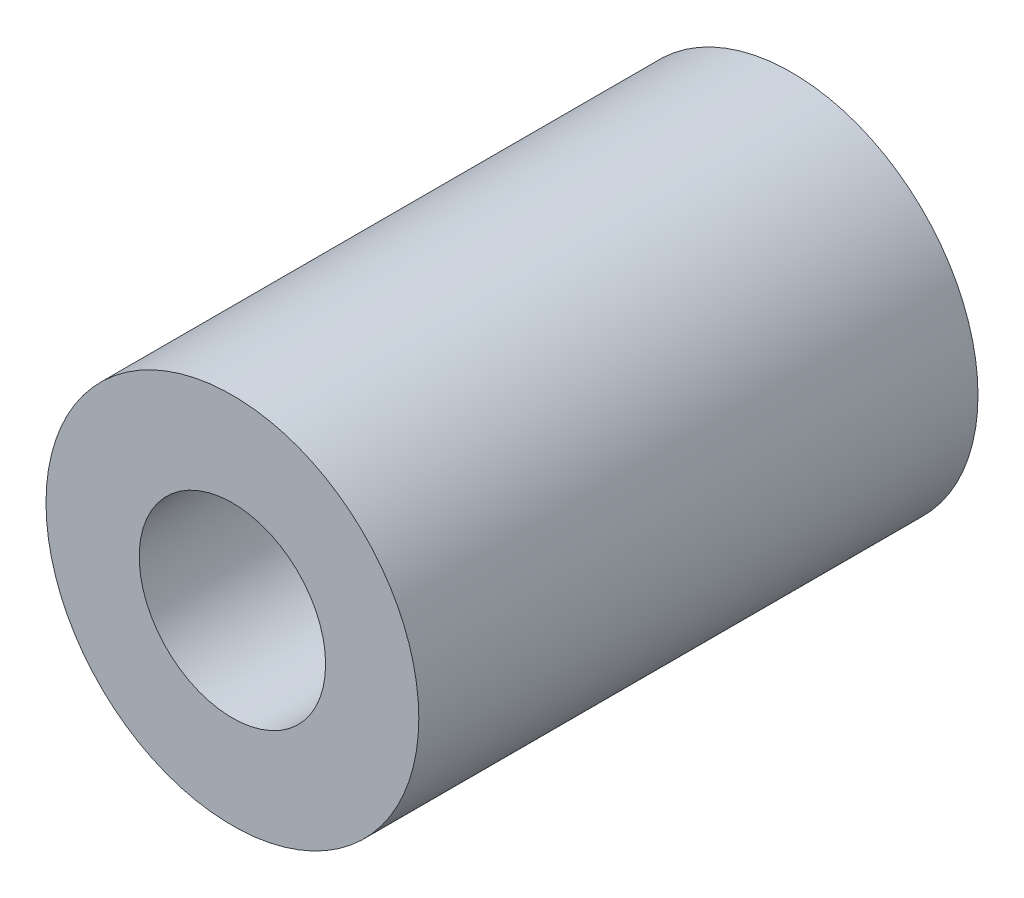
from build123d import *

# Parameters (mm, degrees)
SKETCH1_R          = 10
EXTRUDE1_DEPTH     = 30
SKETCH2_R          = 5
CUT_EXTRUDE1_DEPTH = 34.166247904


with BuildPart() as part:
    # Sketch1 → Extrude1 (new body)
    with BuildSketch(Plane.XY):
        Circle(SKETCH1_R)
    extrude(amount=EXTRUDE1_DEPTH)

    # Sketch2 → Cut-Extrude1 (cut, through all)
    with BuildSketch(Plane.XY.offset(30)):
        Circle(SKETCH2_R)
    extrude(amount=-CUT_EXTRUDE1_DEPTH, mode=Mode.SUBTRACT)


solid = part.part
